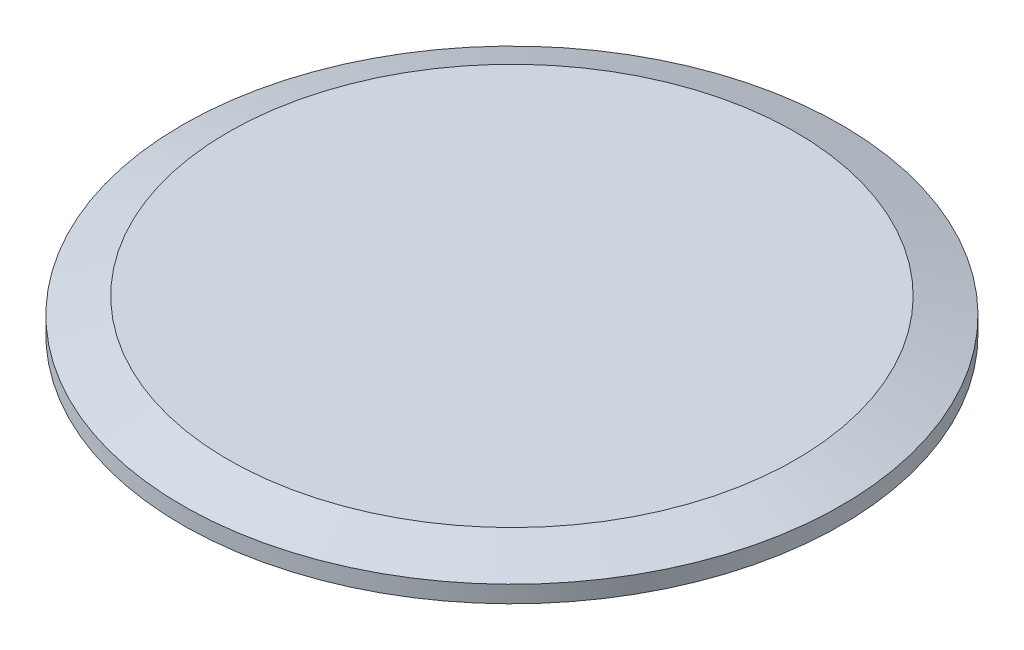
ISO-10303-21;
HEADER;
FILE_DESCRIPTION(('STEP AP214'),'2;1');
FILE_NAME('part.step','',(''),(''),'','','');
FILE_SCHEMA(('AUTOMOTIVE_DESIGN { 1 0 10303 214 1 1 1 1 }'));
ENDSEC;
DATA;
#1=APPLICATION_CONTEXT('core data for automotive mechanical design processes');
#2=APPLICATION_PROTOCOL_DEFINITION('international standard','automotive_design',2000,#1);
#3=PRODUCT_CONTEXT('',#1,'mechanical');
#4=PRODUCT('Part','Part','',(#3));
#5=PRODUCT_RELATED_PRODUCT_CATEGORY('part','',(#4));
#6=PRODUCT_DEFINITION_FORMATION('','',#4);
#7=PRODUCT_DEFINITION_CONTEXT('part definition',#1,'design');
#8=PRODUCT_DEFINITION('design','',#6,#7);
#9=PRODUCT_DEFINITION_SHAPE('','',#8);
#10=(LENGTH_UNIT() NAMED_UNIT(*) SI_UNIT(.MILLI.,.METRE.));
#11=(NAMED_UNIT(*) PLANE_ANGLE_UNIT() SI_UNIT($,.RADIAN.));
#12=(NAMED_UNIT(*) SI_UNIT($,.STERADIAN.) SOLID_ANGLE_UNIT());
#13=UNCERTAINTY_MEASURE_WITH_UNIT(LENGTH_MEASURE(1.E-05),#10,'distance_accuracy_value','');
#14=(GEOMETRIC_REPRESENTATION_CONTEXT(3) GLOBAL_UNCERTAINTY_ASSIGNED_CONTEXT((#13)) GLOBAL_UNIT_ASSIGNED_CONTEXT((#10,
#11,#12)) REPRESENTATION_CONTEXT('',''));
#15=CARTESIAN_POINT('',(0.,0.,0.));
#16=DIRECTION('',(0.,0.,1.));
#17=DIRECTION('',(1.,0.,0.));
#18=AXIS2_PLACEMENT_3D('',#15,#16,#17);
#19=CARTESIAN_POINT('',(-93.69545395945,11.0998,0.));
#20=DIRECTION('',(0.,1.,0.));
#21=DIRECTION('',(-1.,0.,0.));
#22=AXIS2_PLACEMENT_3D('',#19,#20,#21);
#23=PLANE('',#22);
#24=CARTESIAN_POINT('',(0.,11.0998,0.));
#25=DIRECTION('',(0.,1.,0.));
#26=DIRECTION('',(-1.,0.,0.));
#27=AXIS2_PLACEMENT_3D('',#24,#25,#26);
#28=CIRCLE('',#27,93.69545395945);
#29=CARTESIAN_POINT('',(-93.69545395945,11.0998,0.));
#30=VERTEX_POINT('',#29);
#31=EDGE_CURVE('E10',#30,#30,#28,.T.);
#32=ORIENTED_EDGE('',*,*,#31,.T.);
#33=EDGE_LOOP('',(#32));
#34=FACE_BOUND('',#33,.T.);
#35=ADVANCED_FACE('F31',(#34),#23,.T.);
#36=CARTESIAN_POINT('',(0.,11.0998,0.));
#37=DIRECTION('',(0.,-1.,0.));
#38=DIRECTION('',(1.,0.,0.));
#39=AXIS2_PLACEMENT_3D('',#36,#37,#38);
#40=CONICAL_SURFACE('',#39,93.69545395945,1.22173047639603);
#41=CARTESIAN_POINT('',(0.,5.58800000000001,0.));
#42=DIRECTION('',(0.,1.,0.));
#43=DIRECTION('',(-1.,0.,0.));
#44=AXIS2_PLACEMENT_3D('',#41,#42,#43);
#45=CIRCLE('',#44,108.839);
#46=CARTESIAN_POINT('',(-108.839,5.58799999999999,0.));
#47=VERTEX_POINT('',#46);
#48=EDGE_CURVE('E37',#47,#47,#45,.T.);
#49=ORIENTED_EDGE('',*,*,#48,.T.);
#50=EDGE_LOOP('',(#49));
#51=FACE_BOUND('',#50,.T.);
#52=ORIENTED_EDGE('',*,*,#31,.F.);
#53=EDGE_LOOP('',(#52));
#54=FACE_BOUND('',#53,.T.);
#55=ADVANCED_FACE('F72',(#51,#54),#40,.T.);
#56=CARTESIAN_POINT('',(0.,11.0998,0.));
#57=DIRECTION('',(0.,1.,0.));
#58=DIRECTION('',(-1.,0.,0.));
#59=AXIS2_PLACEMENT_3D('',#56,#57,#58);
#60=CYLINDRICAL_SURFACE('',#59,108.839);
#61=CARTESIAN_POINT('',(0.,0.,0.));
#62=DIRECTION('',(0.,1.,0.));
#63=DIRECTION('',(-1.,0.,0.));
#64=AXIS2_PLACEMENT_3D('',#61,#62,#63);
#65=CIRCLE('',#64,108.839);
#66=CARTESIAN_POINT('',(-108.839,0.,0.));
#67=VERTEX_POINT('',#66);
#68=EDGE_CURVE('E41',#67,#67,#65,.T.);
#69=ORIENTED_EDGE('',*,*,#68,.T.);
#70=EDGE_LOOP('',(#69));
#71=FACE_BOUND('',#70,.T.);
#72=ORIENTED_EDGE('',*,*,#48,.F.);
#73=EDGE_LOOP('',(#72));
#74=FACE_BOUND('',#73,.T.);
#75=ADVANCED_FACE('F76',(#71,#74),#60,.T.);
#76=CARTESIAN_POINT('',(-105.399208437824,0.,0.));
#77=DIRECTION('',(0.,-1.,0.));
#78=DIRECTION('',(1.,0.,0.));
#79=AXIS2_PLACEMENT_3D('',#76,#77,#78);
#80=PLANE('',#79);
#81=CARTESIAN_POINT('',(0.,0.,0.));
#82=DIRECTION('',(0.,1.,0.));
#83=DIRECTION('',(-1.,0.,0.));
#84=AXIS2_PLACEMENT_3D('',#81,#82,#83);
#85=CIRCLE('',#84,105.399208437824);
#86=CARTESIAN_POINT('',(-105.399208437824,0.,0.));
#87=VERTEX_POINT('',#86);
#88=EDGE_CURVE('E45',#87,#87,#85,.T.);
#89=ORIENTED_EDGE('',*,*,#88,.T.);
#90=EDGE_LOOP('',(#89));
#91=FACE_BOUND('',#90,.T.);
#92=ORIENTED_EDGE('',*,*,#68,.F.);
#93=EDGE_LOOP('',(#92));
#94=FACE_BOUND('',#93,.T.);
#95=ADVANCED_FACE('F80',(#91,#94),#80,.T.);
#96=CARTESIAN_POINT('',(0.,0.787400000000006,0.));
#97=DIRECTION('',(0.,1.,0.));
#98=DIRECTION('',(-1.,0.,0.));
#99=AXIS2_PLACEMENT_3D('',#96,#97,#98);
#100=TOROIDAL_SURFACE('',#99,105.399208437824,0.787399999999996);
#101=CARTESIAN_POINT('',(0.,0.474458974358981,0.));
#102=DIRECTION('',(0.,1.,0.));
#103=DIRECTION('',(-1.,0.,0.));
#104=AXIS2_PLACEMENT_3D('',#101,#102,#103);
#105=CIRCLE('',#104,104.676666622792);
#106=CARTESIAN_POINT('',(-104.676666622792,0.474458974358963,0.));
#107=VERTEX_POINT('',#106);
#108=EDGE_CURVE('E50',#107,#107,#105,.T.);
#109=ORIENTED_EDGE('',*,*,#108,.T.);
#110=EDGE_LOOP('',(#109));
#111=FACE_BOUND('',#110,.T.);
#112=ORIENTED_EDGE('',*,*,#88,.F.);
#113=EDGE_LOOP('',(#112));
#114=FACE_BOUND('',#113,.T.);
#115=ADVANCED_FACE('F87',(#111,#114),#100,.T.);
#116=CARTESIAN_POINT('',(0.,0.,0.));
#117=DIRECTION('',(0.,1.,0.));
#118=DIRECTION('',(-1.,0.,0.));
#119=AXIS2_PLACEMENT_3D('',#116,#117,#118);
#120=TOROIDAL_SURFACE('',#119,103.5812,1.19380000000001);
#121=CARTESIAN_POINT('',(0.,0.474458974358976,0.));
#122=DIRECTION('',(0.,1.,0.));
#123=DIRECTION('',(-1.,0.,0.));
#124=AXIS2_PLACEMENT_3D('',#121,#122,#123);
#125=CIRCLE('',#124,102.485733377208);
#126=CARTESIAN_POINT('',(-102.485733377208,0.474458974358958,0.));
#127=VERTEX_POINT('',#126);
#128=EDGE_CURVE('E53',#127,#127,#125,.T.);
#129=ORIENTED_EDGE('',*,*,#128,.T.);
#130=EDGE_LOOP('',(#129));
#131=FACE_BOUND('',#130,.T.);
#132=ORIENTED_EDGE('',*,*,#108,.F.);
#133=EDGE_LOOP('',(#132));
#134=FACE_BOUND('',#133,.T.);
#135=ADVANCED_FACE('F69',(#131,#134),#120,.F.);
#136=CARTESIAN_POINT('',(0.,0.787400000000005,0.));
#137=DIRECTION('',(0.,1.,0.));
#138=DIRECTION('',(-1.,0.,0.));
#139=AXIS2_PLACEMENT_3D('',#136,#137,#138);
#140=TOROIDAL_SURFACE('',#139,101.763191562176,0.787399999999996);
#141=CARTESIAN_POINT('',(0.,0.,0.));
#142=DIRECTION('',(0.,1.,0.));
#143=DIRECTION('',(-1.,0.,0.));
#144=AXIS2_PLACEMENT_3D('',#141,#142,#143);
#145=CIRCLE('',#144,101.763191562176);
#146=CARTESIAN_POINT('',(-101.763191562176,0.,0.));
#147=VERTEX_POINT('',#146);
#148=EDGE_CURVE('E56',#147,#147,#145,.T.);
#149=ORIENTED_EDGE('',*,*,#148,.T.);
#150=EDGE_LOOP('',(#149));
#151=FACE_BOUND('',#150,.T.);
#152=ORIENTED_EDGE('',*,*,#128,.F.);
#153=EDGE_LOOP('',(#152));
#154=FACE_BOUND('',#153,.T.);
#155=ADVANCED_FACE('F60',(#151,#154),#140,.T.);
#156=CARTESIAN_POINT('',(0.,0.,0.));
#157=DIRECTION('',(0.,-1.,0.));
#158=DIRECTION('',(1.,0.,0.));
#159=AXIS2_PLACEMENT_3D('',#156,#157,#158);
#160=PLANE('',#159);
#161=ORIENTED_EDGE('',*,*,#148,.F.);
#162=EDGE_LOOP('',(#161));
#163=FACE_BOUND('',#162,.T.);
#164=ADVANCED_FACE('F63',(#163),#160,.T.);
#165=CLOSED_SHELL('',(#35,#55,#75,#95,#115,#135,#155,#164));
#166=MANIFOLD_SOLID_BREP('B2',#165);
#167=ADVANCED_BREP_SHAPE_REPRESENTATION('',(#18,#166),#14);
#168=SHAPE_DEFINITION_REPRESENTATION(#9,#167);
ENDSEC;
END-ISO-10303-21;
